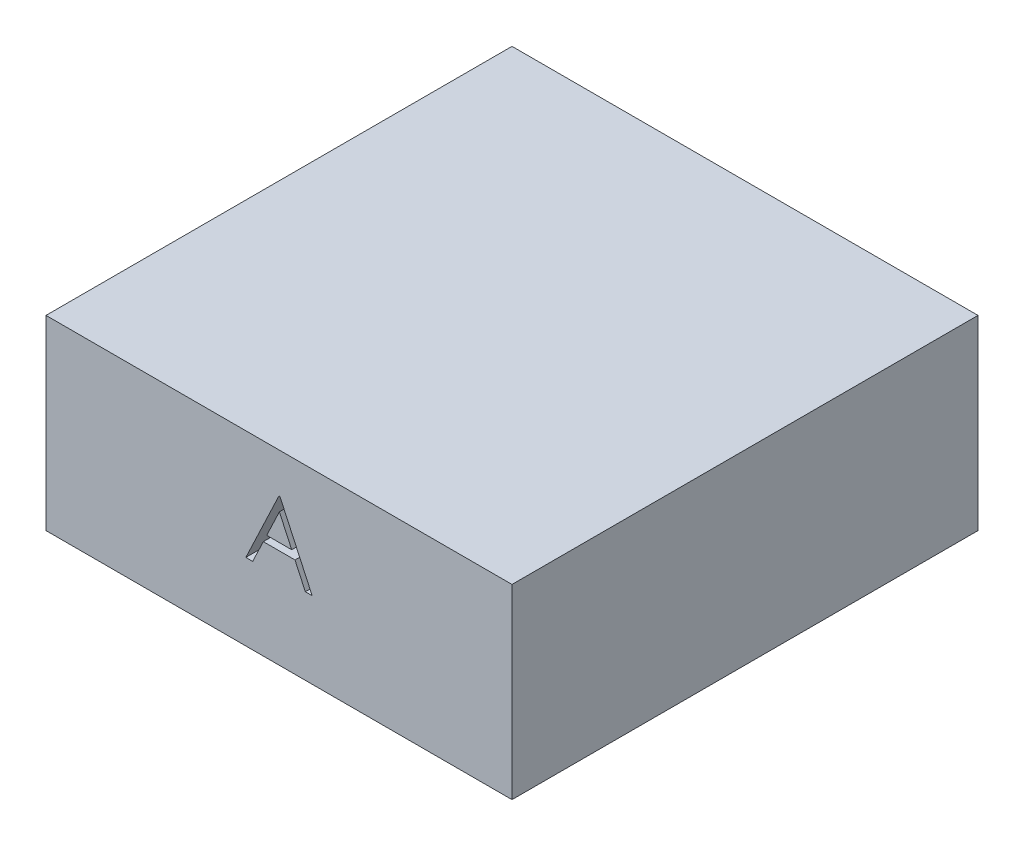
ISO-10303-21;
HEADER;
FILE_DESCRIPTION(('STEP AP214'),'2;1');
FILE_NAME('part.step','',(''),(''),'','','');
FILE_SCHEMA(('AUTOMOTIVE_DESIGN { 1 0 10303 214 1 1 1 1 }'));
ENDSEC;
DATA;
#1=APPLICATION_CONTEXT('core data for automotive mechanical design processes');
#2=APPLICATION_PROTOCOL_DEFINITION('international standard','automotive_design',2000,#1);
#3=PRODUCT_CONTEXT('',#1,'mechanical');
#4=PRODUCT('Part','Part','',(#3));
#5=PRODUCT_RELATED_PRODUCT_CATEGORY('part','',(#4));
#6=PRODUCT_DEFINITION_FORMATION('','',#4);
#7=PRODUCT_DEFINITION_CONTEXT('part definition',#1,'design');
#8=PRODUCT_DEFINITION('design','',#6,#7);
#9=PRODUCT_DEFINITION_SHAPE('','',#8);
#10=(LENGTH_UNIT() NAMED_UNIT(*) SI_UNIT(.MILLI.,.METRE.));
#11=(NAMED_UNIT(*) PLANE_ANGLE_UNIT() SI_UNIT($,.RADIAN.));
#12=(NAMED_UNIT(*) SI_UNIT($,.STERADIAN.) SOLID_ANGLE_UNIT());
#13=UNCERTAINTY_MEASURE_WITH_UNIT(LENGTH_MEASURE(1.E-05),#10,'distance_accuracy_value','');
#14=(GEOMETRIC_REPRESENTATION_CONTEXT(3) GLOBAL_UNCERTAINTY_ASSIGNED_CONTEXT((#13)) GLOBAL_UNIT_ASSIGNED_CONTEXT((#10,
#11,#12)) REPRESENTATION_CONTEXT('',''));
#15=CARTESIAN_POINT('',(0.,0.,0.));
#16=DIRECTION('',(0.,0.,1.));
#17=DIRECTION('',(1.,0.,0.));
#18=AXIS2_PLACEMENT_3D('',#15,#16,#17);
#19=CARTESIAN_POINT('',(-50.,40.,50.));
#20=DIRECTION('',(0.,0.,-1.));
#21=DIRECTION('',(-1.,0.,0.));
#22=AXIS2_PLACEMENT_3D('',#19,#20,#21);
#23=PLANE('',#22);
#24=DIRECTION('',(1.,0.,0.));
#25=VECTOR('',#24,1.);
#26=CARTESIAN_POINT('',(-50.,0.,50.));
#27=LINE('',#26,#25);
#28=CARTESIAN_POINT('',(-50.,0.,50.));
#29=VERTEX_POINT('',#28);
#30=CARTESIAN_POINT('',(50.,0.,50.));
#31=VERTEX_POINT('',#30);
#32=EDGE_CURVE('E506',#29,#31,#27,.T.);
#33=ORIENTED_EDGE('',*,*,#32,.T.);
#34=DIRECTION('',(0.,-1.,0.));
#35=VECTOR('',#34,1.);
#36=CARTESIAN_POINT('',(50.,40.,50.));
#37=LINE('',#36,#35);
#38=CARTESIAN_POINT('',(50.,40.,50.));
#39=VERTEX_POINT('',#38);
#40=EDGE_CURVE('E47',#39,#31,#37,.T.);
#41=ORIENTED_EDGE('',*,*,#40,.F.);
#42=DIRECTION('',(1.,0.,0.));
#43=VECTOR('',#42,1.);
#44=CARTESIAN_POINT('',(-50.,40.,50.));
#45=LINE('',#44,#43);
#46=CARTESIAN_POINT('',(-50.,40.,50.));
#47=VERTEX_POINT('',#46);
#48=EDGE_CURVE('E496',#47,#39,#45,.T.);
#49=ORIENTED_EDGE('',*,*,#48,.F.);
#50=DIRECTION('',(0.,-1.,0.));
#51=VECTOR('',#50,1.);
#52=CARTESIAN_POINT('',(-50.,40.,50.));
#53=LINE('',#52,#51);
#54=EDGE_CURVE('E11',#47,#29,#53,.T.);
#55=ORIENTED_EDGE('',*,*,#54,.T.);
#56=EDGE_LOOP('',(#33,#41,#49,#55));
#57=FACE_BOUND('',#56,.T.);
#58=DIRECTION('',(1.,0.,0.));
#59=VECTOR('',#58,1.);
#60=CARTESIAN_POINT('',(0.,31.4615344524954,50.));
#61=LINE('',#60,#59);
#62=CARTESIAN_POINT('',(0.,31.4615344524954,50.));
#63=VERTEX_POINT('',#62);
#64=CARTESIAN_POINT('',(0.192307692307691,31.4615344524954,50.));
#65=VERTEX_POINT('',#64);
#66=EDGE_CURVE('E54',#63,#65,#61,.T.);
#67=ORIENTED_EDGE('',*,*,#66,.T.);
#68=DIRECTION('',(0.419058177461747,-0.907959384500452,0.));
#69=VECTOR('',#68,1.);
#70=CARTESIAN_POINT('',(0.192307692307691,31.4615344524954,50.));
#71=LINE('',#70,#69);
#72=CARTESIAN_POINT('',(7.11538461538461,16.4615344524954,50.));
#73=VERTEX_POINT('',#72);
#74=EDGE_CURVE('E296',#65,#73,#71,.T.);
#75=ORIENTED_EDGE('',*,*,#74,.T.);
#76=DIRECTION('',(-1.,0.,0.));
#77=VECTOR('',#76,1.);
#78=CARTESIAN_POINT('',(7.11538461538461,16.4615344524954,50.));
#79=LINE('',#78,#77);
#80=CARTESIAN_POINT('',(5.65204326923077,16.4615344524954,50.));
#81=VERTEX_POINT('',#80);
#82=EDGE_CURVE('E299',#73,#81,#79,.T.);
#83=ORIENTED_EDGE('',*,*,#82,.T.);
#84=DIRECTION('',(-0.418842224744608,0.908059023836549,0.));
#85=VECTOR('',#84,1.);
#86=CARTESIAN_POINT('',(5.65204326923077,16.4615344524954,50.));
#87=LINE('',#86,#85);
#88=CARTESIAN_POINT('',(3.43449519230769,21.2692267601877,50.));
#89=VERTEX_POINT('',#88);
#90=EDGE_CURVE('E302',#81,#89,#87,.T.);
#91=ORIENTED_EDGE('',*,*,#90,.T.);
#92=DIRECTION('',(-1.,0.,0.));
#93=VECTOR('',#92,1.);
#94=CARTESIAN_POINT('',(3.43449519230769,21.2692267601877,50.));
#95=LINE('',#94,#93);
#96=CARTESIAN_POINT('',(-3.36538461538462,21.2692267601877,50.));
#97=VERTEX_POINT('',#96);
#98=EDGE_CURVE('E305',#89,#97,#95,.T.);
#99=ORIENTED_EDGE('',*,*,#98,.T.);
#100=DIRECTION('',(-0.428596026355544,-0.903496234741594,0.));
#101=VECTOR('',#100,1.);
#102=CARTESIAN_POINT('',(-3.36538461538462,21.2692267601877,50.));
#103=LINE('',#102,#101);
#104=CARTESIAN_POINT('',(-5.64603365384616,16.4615344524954,50.));
#105=VERTEX_POINT('',#104);
#106=EDGE_CURVE('E308',#97,#105,#103,.T.);
#107=ORIENTED_EDGE('',*,*,#106,.T.);
#108=DIRECTION('',(-1.,0.,0.));
#109=VECTOR('',#108,1.);
#110=CARTESIAN_POINT('',(-5.64603365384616,16.4615344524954,50.));
#111=LINE('',#110,#109);
#112=CARTESIAN_POINT('',(-7.11538461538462,16.4615344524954,50.));
#113=VERTEX_POINT('',#112);
#114=EDGE_CURVE('E311',#105,#113,#111,.T.);
#115=ORIENTED_EDGE('',*,*,#114,.T.);
#116=DIRECTION('',(0.428584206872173,0.903501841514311,0.));
#117=VECTOR('',#116,1.);
#118=CARTESIAN_POINT('',(-7.11538461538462,16.4615344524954,50.));
#119=LINE('',#118,#117);
#120=EDGE_CURVE('E280',#113,#63,#119,.T.);
#121=ORIENTED_EDGE('',*,*,#120,.T.);
#122=EDGE_LOOP('',(#67,#75,#83,#91,#99,#107,#115,#121));
#123=FACE_BOUND('',#122,.T.);
#124=ADVANCED_FACE('F39',(#57,#123),#23,.F.);
#125=CARTESIAN_POINT('',(0.,0.,0.));
#126=DIRECTION('',(0.,1.,0.));
#127=DIRECTION('',(0.,0.,1.));
#128=AXIS2_PLACEMENT_3D('',#125,#126,#127);
#129=PLANE('',#128);
#130=DIRECTION('',(0.,0.,-1.));
#131=VECTOR('',#130,1.);
#132=CARTESIAN_POINT('',(43.2161123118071,0.,-46.3643059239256));
#133=LINE('',#132,#131);
#134=CARTESIAN_POINT('',(43.2161123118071,0.,-34.6301297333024));
#135=VERTEX_POINT('',#134);
#136=CARTESIAN_POINT('',(43.2161123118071,0.,-46.3643059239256));
#137=VERTEX_POINT('',#136);
#138=EDGE_CURVE('E395',#135,#137,#133,.T.);
#139=ORIENTED_EDGE('',*,*,#138,.T.);
#140=DIRECTION('',(-1.,0.,0.));
#141=VECTOR('',#140,1.);
#142=CARTESIAN_POINT('',(32.9129332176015,0.,-46.3643059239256));
#143=LINE('',#142,#141);
#144=CARTESIAN_POINT('',(32.9129332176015,0.,-46.3643059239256));
#145=VERTEX_POINT('',#144);
#146=EDGE_CURVE('E409',#137,#145,#143,.T.);
#147=ORIENTED_EDGE('',*,*,#146,.T.);
#148=DIRECTION('',(0.,0.,1.));
#149=VECTOR('',#148,1.);
#150=CARTESIAN_POINT('',(32.9129332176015,0.,-46.3643059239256));
#151=LINE('',#150,#149);
#152=CARTESIAN_POINT('',(32.9129332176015,0.,-34.6301297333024));
#153=VERTEX_POINT('',#152);
#154=EDGE_CURVE('E412',#145,#153,#151,.T.);
#155=ORIENTED_EDGE('',*,*,#154,.T.);
#156=DIRECTION('',(1.,0.,0.));
#157=VECTOR('',#156,1.);
#158=CARTESIAN_POINT('',(32.9129332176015,0.,-34.6301297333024));
#159=LINE('',#158,#157);
#160=EDGE_CURVE('E400',#153,#135,#159,.T.);
#161=ORIENTED_EDGE('',*,*,#160,.T.);
#162=EDGE_LOOP('',(#139,#147,#155,#161));
#163=FACE_BOUND('',#162,.T.);
#164=DIRECTION('',(0.,0.,1.));
#165=VECTOR('',#164,1.);
#166=CARTESIAN_POINT('',(30.1940387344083,0.,32.3405343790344));
#167=LINE('',#166,#165);
#168=CARTESIAN_POINT('',(30.1940387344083,0.,32.3405343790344));
#169=VERTEX_POINT('',#168);
#170=CARTESIAN_POINT('',(30.1940387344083,0.,41.4989157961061));
#171=VERTEX_POINT('',#170);
#172=EDGE_CURVE('E331',#169,#171,#167,.T.);
#173=ORIENTED_EDGE('',*,*,#172,.T.);
#174=DIRECTION('',(1.,0.,0.));
#175=VECTOR('',#174,1.);
#176=CARTESIAN_POINT('',(38.4938218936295,0.,41.4989157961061));
#177=LINE('',#176,#175);
#178=CARTESIAN_POINT('',(38.4938218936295,0.,41.4989157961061));
#179=VERTEX_POINT('',#178);
#180=EDGE_CURVE('E345',#171,#179,#177,.T.);
#181=ORIENTED_EDGE('',*,*,#180,.T.);
#182=DIRECTION('',(0.,0.,-1.));
#183=VECTOR('',#182,1.);
#184=CARTESIAN_POINT('',(38.4938218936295,0.,32.3405343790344));
#185=LINE('',#184,#183);
#186=CARTESIAN_POINT('',(38.4938218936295,0.,32.3405343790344));
#187=VERTEX_POINT('',#186);
#188=EDGE_CURVE('E348',#179,#187,#185,.T.);
#189=ORIENTED_EDGE('',*,*,#188,.T.);
#190=DIRECTION('',(-1.,0.,0.));
#191=VECTOR('',#190,1.);
#192=CARTESIAN_POINT('',(38.4938218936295,0.,32.3405343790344));
#193=LINE('',#192,#191);
#194=EDGE_CURVE('E336',#187,#169,#193,.T.);
#195=ORIENTED_EDGE('',*,*,#194,.T.);
#196=EDGE_LOOP('',(#173,#181,#189,#195));
#197=FACE_BOUND('',#196,.T.);
#198=CARTESIAN_POINT('',(0.,0.,0.));
#199=DIRECTION('',(0.,-1.,0.));
#200=DIRECTION('',(0.,0.,-1.));
#201=AXIS2_PLACEMENT_3D('',#198,#199,#200);
#202=CIRCLE('',#201,37.5);
#203=CARTESIAN_POINT('',(0.,0.,-37.5));
#204=VERTEX_POINT('',#203);
#205=EDGE_CURVE('E459',#204,#204,#202,.F.);
#206=ORIENTED_EDGE('',*,*,#205,.T.);
#207=EDGE_LOOP('',(#206));
#208=FACE_BOUND('',#207,.T.);
#209=DIRECTION('',(0.,0.,1.));
#210=VECTOR('',#209,1.);
#211=CARTESIAN_POINT('',(-50.,0.,-50.));
#212=LINE('',#211,#210);
#213=CARTESIAN_POINT('',(-50.,0.,-50.));
#214=VERTEX_POINT('',#213);
#215=EDGE_CURVE('E490',#214,#29,#212,.T.);
#216=ORIENTED_EDGE('',*,*,#215,.F.);
#217=DIRECTION('',(-1.,0.,0.));
#218=VECTOR('',#217,1.);
#219=CARTESIAN_POINT('',(-50.,0.,-50.));
#220=LINE('',#219,#218);
#221=CARTESIAN_POINT('',(50.,0.,-50.));
#222=VERTEX_POINT('',#221);
#223=EDGE_CURVE('E497',#222,#214,#220,.T.);
#224=ORIENTED_EDGE('',*,*,#223,.F.);
#225=DIRECTION('',(0.,0.,-1.));
#226=VECTOR('',#225,1.);
#227=CARTESIAN_POINT('',(50.,0.,-50.));
#228=LINE('',#227,#226);
#229=EDGE_CURVE('E508',#31,#222,#228,.T.);
#230=ORIENTED_EDGE('',*,*,#229,.F.);
#231=ORIENTED_EDGE('',*,*,#32,.F.);
#232=EDGE_LOOP('',(#216,#224,#230,#231));
#233=FACE_BOUND('',#232,.T.);
#234=DIRECTION('',(0.,0.,-1.));
#235=VECTOR('',#234,1.);
#236=CARTESIAN_POINT('',(-38.780021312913,0.,23.611452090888));
#237=LINE('',#236,#235);
#238=CARTESIAN_POINT('',(-38.780021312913,0.,44.2178102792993));
#239=VERTEX_POINT('',#238);
#240=CARTESIAN_POINT('',(-38.780021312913,0.,23.611452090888));
#241=VERTEX_POINT('',#240);
#242=EDGE_CURVE('E363',#239,#241,#237,.T.);
#243=ORIENTED_EDGE('',*,*,#242,.T.);
#244=DIRECTION('',(-1.,0.,0.));
#245=VECTOR('',#244,1.);
#246=CARTESIAN_POINT('',(-45.9350067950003,0.,23.611452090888));
#247=LINE('',#246,#245);
#248=CARTESIAN_POINT('',(-45.9350067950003,0.,23.611452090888));
#249=VERTEX_POINT('',#248);
#250=EDGE_CURVE('E377',#241,#249,#247,.T.);
#251=ORIENTED_EDGE('',*,*,#250,.T.);
#252=DIRECTION('',(0.,0.,1.));
#253=VECTOR('',#252,1.);
#254=CARTESIAN_POINT('',(-45.9350067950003,0.,23.611452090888));
#255=LINE('',#254,#253);
#256=CARTESIAN_POINT('',(-45.9350067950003,0.,44.2178102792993));
#257=VERTEX_POINT('',#256);
#258=EDGE_CURVE('E380',#249,#257,#255,.T.);
#259=ORIENTED_EDGE('',*,*,#258,.T.);
#260=DIRECTION('',(1.,0.,0.));
#261=VECTOR('',#260,1.);
#262=CARTESIAN_POINT('',(-45.9350067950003,0.,44.2178102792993));
#263=LINE('',#262,#261);
#264=EDGE_CURVE('E368',#257,#239,#263,.T.);
#265=ORIENTED_EDGE('',*,*,#264,.T.);
#266=EDGE_LOOP('',(#243,#251,#259,#265));
#267=FACE_BOUND('',#266,.T.);
#268=DIRECTION('',(0.,0.,-1.));
#269=VECTOR('',#268,1.);
#270=CARTESIAN_POINT('',(-37.7783233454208,0.,-43.0730126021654));
#271=LINE('',#270,#269);
#272=CARTESIAN_POINT('',(-37.7783233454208,0.,-37.9214230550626));
#273=VERTEX_POINT('',#272);
#274=CARTESIAN_POINT('',(-37.7783233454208,0.,-43.0730126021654));
#275=VERTEX_POINT('',#274);
#276=EDGE_CURVE('E427',#273,#275,#271,.T.);
#277=ORIENTED_EDGE('',*,*,#276,.T.);
#278=DIRECTION('',(-1.,0.,0.));
#279=VECTOR('',#278,1.);
#280=CARTESIAN_POINT('',(-46.9367047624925,0.,-43.0730126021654));
#281=LINE('',#280,#279);
#282=CARTESIAN_POINT('',(-46.9367047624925,0.,-43.0730126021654));
#283=VERTEX_POINT('',#282);
#284=EDGE_CURVE('E441',#275,#283,#281,.T.);
#285=ORIENTED_EDGE('',*,*,#284,.T.);
#286=DIRECTION('',(0.,0.,1.));
#287=VECTOR('',#286,1.);
#288=CARTESIAN_POINT('',(-46.9367047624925,0.,-43.0730126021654));
#289=LINE('',#288,#287);
#290=CARTESIAN_POINT('',(-46.9367047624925,0.,-37.9214230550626));
#291=VERTEX_POINT('',#290);
#292=EDGE_CURVE('E444',#283,#291,#289,.T.);
#293=ORIENTED_EDGE('',*,*,#292,.T.);
#294=DIRECTION('',(1.,0.,0.));
#295=VECTOR('',#294,1.);
#296=CARTESIAN_POINT('',(-46.9367047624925,0.,-37.9214230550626));
#297=LINE('',#296,#295);
#298=EDGE_CURVE('E432',#291,#273,#297,.T.);
#299=ORIENTED_EDGE('',*,*,#298,.T.);
#300=EDGE_LOOP('',(#277,#285,#293,#299));
#301=FACE_BOUND('',#300,.T.);
#302=ADVANCED_FACE('F526',(#163,#197,#208,#233,#267,#301),#129,.F.);
#303=CARTESIAN_POINT('',(-50.,40.,-50.));
#304=DIRECTION('',(1.,0.,0.));
#305=DIRECTION('',(0.,0.,-1.));
#306=AXIS2_PLACEMENT_3D('',#303,#304,#305);
#307=PLANE('',#306);
#308=ORIENTED_EDGE('',*,*,#215,.T.);
#309=ORIENTED_EDGE('',*,*,#54,.F.);
#310=DIRECTION('',(0.,0.,1.));
#311=VECTOR('',#310,1.);
#312=CARTESIAN_POINT('',(-50.,40.,-50.));
#313=LINE('',#312,#311);
#314=CARTESIAN_POINT('',(-50.,40.,-50.));
#315=VERTEX_POINT('',#314);
#316=EDGE_CURVE('E493',#315,#47,#313,.T.);
#317=ORIENTED_EDGE('',*,*,#316,.F.);
#318=DIRECTION('',(0.,-1.,0.));
#319=VECTOR('',#318,1.);
#320=CARTESIAN_POINT('',(-50.,40.,-50.));
#321=LINE('',#320,#319);
#322=EDGE_CURVE('E503',#315,#214,#321,.T.);
#323=ORIENTED_EDGE('',*,*,#322,.T.);
#324=EDGE_LOOP('',(#308,#309,#317,#323));
#325=FACE_BOUND('',#324,.T.);
#326=ADVANCED_FACE('F41',(#325),#307,.F.);
#327=CARTESIAN_POINT('',(50.,40.,-50.));
#328=DIRECTION('',(-1.,0.,0.));
#329=DIRECTION('',(0.,0.,1.));
#330=AXIS2_PLACEMENT_3D('',#327,#328,#329);
#331=PLANE('',#330);
#332=ORIENTED_EDGE('',*,*,#229,.T.);
#333=DIRECTION('',(0.,-1.,0.));
#334=VECTOR('',#333,1.);
#335=CARTESIAN_POINT('',(50.,40.,-50.));
#336=LINE('',#335,#334);
#337=CARTESIAN_POINT('',(50.,40.,-50.));
#338=VERTEX_POINT('',#337);
#339=EDGE_CURVE('E513',#338,#222,#336,.T.);
#340=ORIENTED_EDGE('',*,*,#339,.F.);
#341=DIRECTION('',(0.,0.,-1.));
#342=VECTOR('',#341,1.);
#343=CARTESIAN_POINT('',(50.,40.,-50.));
#344=LINE('',#343,#342);
#345=EDGE_CURVE('E499',#39,#338,#344,.T.);
#346=ORIENTED_EDGE('',*,*,#345,.F.);
#347=ORIENTED_EDGE('',*,*,#40,.T.);
#348=EDGE_LOOP('',(#332,#340,#346,#347));
#349=FACE_BOUND('',#348,.T.);
#350=ADVANCED_FACE('F520',(#349),#331,.F.);
#351=CARTESIAN_POINT('',(-50.,40.,-50.));
#352=DIRECTION('',(0.,0.,1.));
#353=DIRECTION('',(1.,0.,0.));
#354=AXIS2_PLACEMENT_3D('',#351,#352,#353);
#355=PLANE('',#354);
#356=ORIENTED_EDGE('',*,*,#223,.T.);
#357=ORIENTED_EDGE('',*,*,#322,.F.);
#358=DIRECTION('',(-1.,0.,0.));
#359=VECTOR('',#358,1.);
#360=CARTESIAN_POINT('',(-50.,40.,-50.));
#361=LINE('',#360,#359);
#362=EDGE_CURVE('E501',#338,#315,#361,.T.);
#363=ORIENTED_EDGE('',*,*,#362,.F.);
#364=ORIENTED_EDGE('',*,*,#339,.T.);
#365=EDGE_LOOP('',(#356,#357,#363,#364));
#366=FACE_BOUND('',#365,.T.);
#367=ADVANCED_FACE('F530',(#366),#355,.F.);
#368=CARTESIAN_POINT('',(0.,40.,0.));
#369=DIRECTION('',(0.,1.,0.));
#370=DIRECTION('',(0.,0.,1.));
#371=AXIS2_PLACEMENT_3D('',#368,#369,#370);
#372=PLANE('',#371);
#373=ORIENTED_EDGE('',*,*,#316,.T.);
#374=ORIENTED_EDGE('',*,*,#48,.T.);
#375=ORIENTED_EDGE('',*,*,#345,.T.);
#376=ORIENTED_EDGE('',*,*,#362,.T.);
#377=EDGE_LOOP('',(#373,#374,#375,#376));
#378=FACE_BOUND('',#377,.T.);
#379=ADVANCED_FACE('F536',(#378),#372,.T.);
#380=CARTESIAN_POINT('',(0.,21.5943026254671,0.));
#381=DIRECTION('',(0.,1.,0.));
#382=DIRECTION('',(-1.,0.,0.));
#383=AXIS2_PLACEMENT_3D('',#380,#381,#382);
#384=TOROIDAL_SURFACE('',#383,24.2886000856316,5.);
#385=CARTESIAN_POINT('',(0.,24.9165030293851,0.));
#386=DIRECTION('',(0.,-1.,0.));
#387=DIRECTION('',(1.,0.,0.));
#388=AXIS2_PLACEMENT_3D('',#385,#386,#387);
#389=CIRCLE('',#388,28.0253077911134);
#390=CARTESIAN_POINT('',(28.0253077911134,24.9165030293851,0.));
#391=VERTEX_POINT('',#390);
#392=EDGE_CURVE('E487',#391,#391,#389,.T.);
#393=ORIENTED_EDGE('',*,*,#392,.T.);
#394=EDGE_LOOP('',(#393));
#395=FACE_BOUND('',#394,.T.);
#396=CARTESIAN_POINT('',(0.,26.5943026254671,0.));
#397=DIRECTION('',(0.,1.,0.));
#398=DIRECTION('',(-1.,0.,0.));
#399=AXIS2_PLACEMENT_3D('',#396,#397,#398);
#400=CIRCLE('',#399,24.2886000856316);
#401=CARTESIAN_POINT('',(-24.2886000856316,26.5943026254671,0.));
#402=VERTEX_POINT('',#401);
#403=EDGE_CURVE('E484',#402,#402,#400,.T.);
#404=ORIENTED_EDGE('',*,*,#403,.T.);
#405=EDGE_LOOP('',(#404));
#406=FACE_BOUND('',#405,.T.);
#407=ADVANCED_FACE('F714',(#395,#406),#384,.F.);
#408=CARTESIAN_POINT('',(0.,27.5943026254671,0.));
#409=DIRECTION('',(0.,-1.,0.));
#410=DIRECTION('',(1.,0.,0.));
#411=AXIS2_PLACEMENT_3D('',#408,#409,#410);
#412=TOROIDAL_SURFACE('',#411,3.73626592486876,1.);
#413=CARTESIAN_POINT('',(0.,27.2522824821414,0.));
#414=DIRECTION('',(0.,1.,0.));
#415=DIRECTION('',(-1.,0.,0.));
#416=AXIS2_PLACEMENT_3D('',#413,#414,#415);
#417=CIRCLE('',#416,4.67595854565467);
#418=CARTESIAN_POINT('',(-4.67595854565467,27.2522824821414,0.));
#419=VERTEX_POINT('',#418);
#420=EDGE_CURVE('E475',#419,#419,#417,.F.);
#421=ORIENTED_EDGE('',*,*,#420,.T.);
#422=EDGE_LOOP('',(#421));
#423=FACE_BOUND('',#422,.T.);
#424=CARTESIAN_POINT('',(0.,26.5943026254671,0.));
#425=DIRECTION('',(0.,-1.,0.));
#426=DIRECTION('',(1.,0.,0.));
#427=AXIS2_PLACEMENT_3D('',#424,#425,#426);
#428=CIRCLE('',#427,3.73626592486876);
#429=CARTESIAN_POINT('',(3.73626592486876,26.5943026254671,0.));
#430=VERTEX_POINT('',#429);
#431=EDGE_CURVE('E481',#430,#430,#428,.F.);
#432=ORIENTED_EDGE('',*,*,#431,.T.);
#433=EDGE_LOOP('',(#432));
#434=FACE_BOUND('',#433,.T.);
#435=ADVANCED_FACE('F710',(#423,#434),#412,.T.);
#436=CARTESIAN_POINT('',(0.,35.4427726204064,0.));
#437=DIRECTION('',(0.,-1.,0.));
#438=DIRECTION('',(1.,0.,0.));
#439=AXIS2_PLACEMENT_3D('',#436,#437,#438);
#440=TOROIDAL_SURFACE('',#439,8.72123093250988,1.);
#441=CARTESIAN_POINT('',(0.,36.4138074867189,0.));
#442=DIRECTION('',(0.,-1.,0.));
#443=DIRECTION('',(1.,0.,0.));
#444=AXIS2_PLACEMENT_3D('',#441,#442,#443);
#445=CIRCLE('',#444,8.96016876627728);
#446=CARTESIAN_POINT('',(8.96016876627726,36.413807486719,0.));
#447=VERTEX_POINT('',#446);
#448=EDGE_CURVE('E460',#447,#447,#445,.T.);
#449=ORIENTED_EDGE('',*,*,#448,.T.);
#450=EDGE_LOOP('',(#449));
#451=FACE_BOUND('',#450,.T.);
#452=CARTESIAN_POINT('',(0.,35.7847927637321,0.));
#453=DIRECTION('',(0.,1.,0.));
#454=DIRECTION('',(-1.,0.,0.));
#455=AXIS2_PLACEMENT_3D('',#452,#453,#454);
#456=CIRCLE('',#455,7.78153831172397);
#457=CARTESIAN_POINT('',(-7.78153831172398,35.7847927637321,0.));
#458=VERTEX_POINT('',#457);
#459=EDGE_CURVE('E478',#458,#458,#456,.T.);
#460=ORIENTED_EDGE('',*,*,#459,.T.);
#461=EDGE_LOOP('',(#460));
#462=FACE_BOUND('',#461,.T.);
#463=ADVANCED_FACE('F706',(#451,#462),#440,.F.);
#464=CARTESIAN_POINT('',(0.,27.5943026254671,0.));
#465=DIRECTION('',(0.,1.,0.));
#466=DIRECTION('',(-1.,0.,0.));
#467=AXIS2_PLACEMENT_3D('',#464,#465,#466);
#468=TOROIDAL_SURFACE('',#467,19.1318013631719,1.);
#469=CARTESIAN_POINT('',(0.,26.5943026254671,0.));
#470=DIRECTION('',(0.,1.,0.));
#471=DIRECTION('',(-1.,0.,0.));
#472=AXIS2_PLACEMENT_3D('',#469,#470,#471);
#473=CIRCLE('',#472,19.1318013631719);
#474=CARTESIAN_POINT('',(-19.1318013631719,26.5943026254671,0.));
#475=VERTEX_POINT('',#474);
#476=EDGE_CURVE('E472',#475,#475,#473,.F.);
#477=ORIENTED_EDGE('',*,*,#476,.T.);
#478=EDGE_LOOP('',(#477));
#479=FACE_BOUND('',#478,.T.);
#480=CARTESIAN_POINT('',(0.,27.2435888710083,0.));
#481=DIRECTION('',(0.,-1.,0.));
#482=DIRECTION('',(1.,0.,0.));
#483=AXIS2_PLACEMENT_3D('',#480,#481,#482);
#484=CIRCLE('',#483,18.195318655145);
#485=CARTESIAN_POINT('',(18.195318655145,27.2435888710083,0.));
#486=VERTEX_POINT('',#485);
#487=EDGE_CURVE('E466',#486,#486,#484,.F.);
#488=ORIENTED_EDGE('',*,*,#487,.T.);
#489=EDGE_LOOP('',(#488));
#490=FACE_BOUND('',#489,.T.);
#491=ADVANCED_FACE('F702',(#479,#490),#468,.T.);
#492=CARTESIAN_POINT('',(0.,33.3460961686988,0.));
#493=DIRECTION('',(0.,-1.,0.));
#494=DIRECTION('',(1.,0.,0.));
#495=AXIS2_PLACEMENT_3D('',#492,#493,#494);
#496=TOROIDAL_SURFACE('',#495,14.8420979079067,1.);
#497=CARTESIAN_POINT('',(0.,33.6968099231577,0.));
#498=DIRECTION('',(0.,1.,0.));
#499=DIRECTION('',(-1.,0.,0.));
#500=AXIS2_PLACEMENT_3D('',#497,#498,#499);
#501=CIRCLE('',#500,15.7785806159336);
#502=CARTESIAN_POINT('',(-15.7785806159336,33.6968099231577,0.));
#503=VERTEX_POINT('',#502);
#504=EDGE_CURVE('E469',#503,#503,#501,.F.);
#505=ORIENTED_EDGE('',*,*,#504,.T.);
#506=EDGE_LOOP('',(#505));
#507=FACE_BOUND('',#506,.T.);
#508=CARTESIAN_POINT('',(0.,34.2596878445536,0.));
#509=DIRECTION('',(0.,-1.,0.));
#510=DIRECTION('',(1.,0.,0.));
#511=AXIS2_PLACEMENT_3D('',#508,#509,#510);
#512=CIRCLE('',#511,15.2487307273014);
#513=CARTESIAN_POINT('',(15.2487307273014,34.2596878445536,0.));
#514=VERTEX_POINT('',#513);
#515=EDGE_CURVE('E463',#514,#514,#512,.F.);
#516=ORIENTED_EDGE('',*,*,#515,.T.);
#517=EDGE_LOOP('',(#516));
#518=FACE_BOUND('',#517,.T.);
#519=ADVANCED_FACE('F680',(#507,#518),#496,.F.);
#520=CARTESIAN_POINT('',(0.,26.5943026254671,0.));
#521=DIRECTION('',(0.,-1.,0.));
#522=DIRECTION('',(1.,0.,0.));
#523=AXIS2_PLACEMENT_3D('',#520,#521,#522);
#524=PLANE('',#523);
#525=ORIENTED_EDGE('',*,*,#431,.F.);
#526=EDGE_LOOP('',(#525));
#527=FACE_BOUND('',#526,.T.);
#528=ADVANCED_FACE('F676',(#527),#524,.T.);
#529=CARTESIAN_POINT('',(0.,36.6181019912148,0.));
#530=DIRECTION('',(0.,1.,0.));
#531=DIRECTION('',(-1.,0.,0.));
#532=AXIS2_PLACEMENT_3D('',#529,#530,#531);
#533=CONICAL_SURFACE('',#532,8.08483806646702,0.349065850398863);
#534=ORIENTED_EDGE('',*,*,#459,.F.);
#535=EDGE_LOOP('',(#534));
#536=FACE_BOUND('',#535,.T.);
#537=ORIENTED_EDGE('',*,*,#420,.F.);
#538=EDGE_LOOP('',(#537));
#539=FACE_BOUND('',#538,.T.);
#540=ADVANCED_FACE('F679',(#536,#539),#533,.T.);
#541=CARTESIAN_POINT('',(0.,0.,0.));
#542=DIRECTION('',(0.,1.,0.));
#543=DIRECTION('',(1.,0.,0.));
#544=AXIS2_PLACEMENT_3D('',#541,#542,#543);
#545=SPHERICAL_SURFACE('',#544,37.5);
#546=CARTESIAN_POINT('',(15.2487307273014,34.2596878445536,0.));
#547=CARTESIAN_POINT('',(15.1853883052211,34.2878810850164,0.));
#548=CARTESIAN_POINT('',(15.1219676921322,34.3158986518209,0.));
#549=CARTESIAN_POINT('',(14.994972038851,34.3715815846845,0.));
#550=CARTESIAN_POINT('',(14.9313969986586,34.3992469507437,0.));
#551=CARTESIAN_POINT('',(14.804094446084,34.4542246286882,0.));
#552=CARTESIAN_POINT('',(14.7403669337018,34.4815369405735,0.));
#553=CARTESIAN_POINT('',(14.6127613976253,34.5358076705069,0.));
#554=CARTESIAN_POINT('',(14.548883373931,34.5627660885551,0.));
#555=CARTESIAN_POINT('',(14.4209787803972,34.6163282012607,0.));
#556=CARTESIAN_POINT('',(14.3569522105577,34.6429318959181,0.));
#557=CARTESIAN_POINT('',(14.2287524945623,34.6957837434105,0.));
#558=CARTESIAN_POINT('',(14.1645793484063,34.7220318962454,0.));
#559=CARTESIAN_POINT('',(14.0360884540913,34.7741718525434,0.));
#560=CARTESIAN_POINT('',(13.9717707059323,34.8000636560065,0.));
#561=CARTESIAN_POINT('',(13.8429925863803,34.8514901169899,0.));
#562=CARTESIAN_POINT('',(13.7785322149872,34.8770247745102,0.));
#563=CARTESIAN_POINT('',(13.6494708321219,34.9277361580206,0.));
#564=CARTESIAN_POINT('',(13.5848698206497,34.9529128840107,0.));
#565=CARTESIAN_POINT('',(13.4555291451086,35.0029076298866,0.));
#566=CARTESIAN_POINT('',(13.3907894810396,35.0277256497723,0.));
#567=CARTESIAN_POINT('',(13.2611734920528,35.0770022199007,0.));
#568=CARTESIAN_POINT('',(13.196297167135,35.1014607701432,0.));
#569=CARTESIAN_POINT('',(13.0664098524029,35.1500176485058,0.));
#570=CARTESIAN_POINT('',(13.0013988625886,35.1741159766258,0.));
#571=CARTESIAN_POINT('',(12.871244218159,35.2219516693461,0.));
#572=CARTESIAN_POINT('',(12.8061005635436,35.2456890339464,0.));
#573=CARTESIAN_POINT('',(12.6756825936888,35.2928020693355,0.));
#574=CARTESIAN_POINT('',(12.6104082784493,35.3161777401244,0.));
#575=CARTESIAN_POINT('',(12.479730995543,35.3625666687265,0.));
#576=CARTESIAN_POINT('',(12.4143280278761,35.3855799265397,0.));
#577=CARTESIAN_POINT('',(12.2833954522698,35.4312433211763,0.));
#578=CARTESIAN_POINT('',(12.2178658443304,35.4538934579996,0.));
#579=CARTESIAN_POINT('',(12.0866820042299,35.4988299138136,0.));
#580=CARTESIAN_POINT('',(12.0210277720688,35.5211162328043,0.));
#581=CARTESIAN_POINT('',(11.8895967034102,35.5653243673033,0.));
#582=CARTESIAN_POINT('',(11.8238198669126,35.5872461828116,0.));
#583=CARTESIAN_POINT('',(11.692145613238,35.6307246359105,0.));
#584=CARTESIAN_POINT('',(11.626248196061,35.652281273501,0.));
#585=CARTESIAN_POINT('',(11.4943348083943,35.6950287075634,0.));
#586=CARTESIAN_POINT('',(11.4283188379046,35.7162195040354,0.));
#587=CARTESIAN_POINT('',(11.2961703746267,35.7582346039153,0.));
#588=CARTESIAN_POINT('',(11.2300378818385,35.7790589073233,0.));
#589=CARTESIAN_POINT('',(11.0976584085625,35.8203403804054,0.));
#590=CARTESIAN_POINT('',(11.0314114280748,35.8407975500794,0.));
#591=CARTESIAN_POINT('',(10.8988050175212,35.8813441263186,0.));
#592=CARTESIAN_POINT('',(10.8324455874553,35.9014335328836,0.));
#593=CARTESIAN_POINT('',(10.6996163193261,35.9412439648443,0.));
#594=CARTESIAN_POINT('',(10.6331464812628,35.9609649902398,0.));
#595=CARTESIAN_POINT('',(10.5000984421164,36.0000380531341,0.));
#596=CARTESIAN_POINT('',(10.4335202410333,36.0193900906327,0.));
#597=CARTESIAN_POINT('',(10.300257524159,36.0577245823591,0.));
#598=CARTESIAN_POINT('',(10.2335730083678,36.0767070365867,0.));
#599=CARTESIAN_POINT('',(10.1000997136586,36.114301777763,0.));
#600=CARTESIAN_POINT('',(10.0333109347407,36.1329140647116,0.));
#601=CARTESIAN_POINT('',(9.89963116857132,36.169767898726,0.));
#602=CARTESIAN_POINT('',(9.83274018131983,36.1880094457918,0.));
#603=CARTESIAN_POINT('',(9.69885805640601,36.2241212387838,0.));
#604=CARTESIAN_POINT('',(9.63186691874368,36.2419914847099,0.));
#605=CARTESIAN_POINT('',(9.49778655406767,36.2773601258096,0.));
#606=CARTESIAN_POINT('',(9.43069732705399,36.2948585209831,0.));
#607=CARTESIAN_POINT('',(9.29642284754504,36.329482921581,0.));
#608=CARTESIAN_POINT('',(9.22923759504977,36.3466089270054,0.));
#609=CARTESIAN_POINT('',(9.09477313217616,36.3804880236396,0.));
#610=CARTESIAN_POINT('',(9.02749392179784,36.3972411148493,0.));
#611=CARTESIAN_POINT('',(8.96016876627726,36.413807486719,0.));
#612=B_SPLINE_CURVE_WITH_KNOTS('',3,(#546,#547,#548,#549,#550,#551,#552,#553,#554,#555,#556,
#557,#558,#559,#560,#561,#562,#563,#564,#565,#566,#567,#568,#569,#570,#571,#572,#573,#574,#575,
#576,#577,#578,#579,#580,#581,#582,#583,#584,#585,#586,#587,#588,#589,#590,#591,#592,#593,#594,
#595,#596,#597,#598,#599,#600,#601,#602,#603,#604,#605,#606,#607,#608,#609,#610,#611),
.UNSPECIFIED.,.F.,.F.,(4,2,2,2,2,2,2,2,2,2,2,2,2,2,2,2,2,2,2,2,2,2,2,2,2,2,2,2,2,2,2,2,4),(0.,
0.20799995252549,0.415999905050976,0.623999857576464,0.831999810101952,1.03999976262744,
1.24799971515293,1.45599966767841,1.66399962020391,1.8719995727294,2.07999952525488,
2.28799947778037,2.49599943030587,2.70399938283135,2.91199933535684,3.11999928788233,
3.32799924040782,3.53599919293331,3.74399914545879,3.95199909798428,4.15999905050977,
4.36799900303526,4.57599895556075,4.78399890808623,4.99199886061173,5.19999881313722,
5.4079987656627,5.61599871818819,5.82399867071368,6.03199862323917,6.23999857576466,
6.44799852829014,6.65599848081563),.UNSPECIFIED.);
#613=EDGE_CURVE('BSEAM684',#514,#447,#612,.T.);
#614=ORIENTED_EDGE('',*,*,#515,.F.);
#615=ORIENTED_EDGE('',*,*,#448,.F.);
#616=ORIENTED_EDGE('',*,*,#613,.T.);
#617=ORIENTED_EDGE('',*,*,#613,.F.);
#618=EDGE_LOOP('',(#614,#616,#615,#617));
#619=FACE_BOUND('',#618,.T.);
#620=ADVANCED_FACE('F684',(#619),#545,.F.);
#621=CARTESIAN_POINT('',(0.,34.0861642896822,0.));
#622=DIRECTION('',(0.,-1.,0.));
#623=DIRECTION('',(1.,0.,0.));
#624=AXIS2_PLACEMENT_3D('',#621,#622,#623);
#625=CONICAL_SURFACE('',#624,15.632766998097,0.358333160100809);
#626=ORIENTED_EDGE('',*,*,#504,.F.);
#627=EDGE_LOOP('',(#626));
#628=FACE_BOUND('',#627,.T.);
#629=ORIENTED_EDGE('',*,*,#487,.F.);
#630=EDGE_LOOP('',(#629));
#631=FACE_BOUND('',#630,.T.);
#632=ADVANCED_FACE('F688',(#628,#631),#625,.F.);
#633=CARTESIAN_POINT('',(0.,26.5943026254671,0.));
#634=DIRECTION('',(0.,1.,0.));
#635=DIRECTION('',(-1.,0.,0.));
#636=AXIS2_PLACEMENT_3D('',#633,#634,#635);
#637=PLANE('',#636);
#638=ORIENTED_EDGE('',*,*,#403,.F.);
#639=EDGE_LOOP('',(#638));
#640=FACE_BOUND('',#639,.T.);
#641=ORIENTED_EDGE('',*,*,#476,.F.);
#642=EDGE_LOOP('',(#641));
#643=FACE_BOUND('',#642,.T.);
#644=ADVANCED_FACE('F692',(#640,#643),#637,.F.);
#645=CARTESIAN_POINT('',(0.,0.,0.));
#646=DIRECTION('',(0.,1.,0.));
#647=DIRECTION('',(1.,0.,0.));
#648=AXIS2_PLACEMENT_3D('',#645,#646,#647);
#649=SPHERICAL_SURFACE('',#648,37.5);
#650=ORIENTED_EDGE('',*,*,#392,.F.);
#651=EDGE_LOOP('',(#650));
#652=FACE_BOUND('',#651,.T.);
#653=ORIENTED_EDGE('',*,*,#205,.F.);
#654=EDGE_LOOP('',(#653));
#655=FACE_BOUND('',#654,.T.);
#656=ADVANCED_FACE('F600',(#652,#655),#649,.F.);
#657=CARTESIAN_POINT('',(0.,15.,0.));
#658=DIRECTION('',(0.,-1.,0.));
#659=DIRECTION('',(0.,0.,-1.));
#660=AXIS2_PLACEMENT_3D('',#657,#658,#659);
#661=PLANE('',#660);
#662=DIRECTION('',(0.,0.,1.));
#663=VECTOR('',#662,1.);
#664=CARTESIAN_POINT('',(30.1940387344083,15.,32.3405343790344));
#665=LINE('',#664,#663);
#666=CARTESIAN_POINT('',(30.1940387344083,15.,32.3405343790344));
#667=VERTEX_POINT('',#666);
#668=CARTESIAN_POINT('',(30.1940387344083,15.,41.4989157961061));
#669=VERTEX_POINT('',#668);
#670=EDGE_CURVE('E332',#667,#669,#665,.T.);
#671=ORIENTED_EDGE('',*,*,#670,.F.);
#672=DIRECTION('',(-1.,0.,0.));
#673=VECTOR('',#672,1.);
#674=CARTESIAN_POINT('',(38.4938218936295,15.,32.3405343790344));
#675=LINE('',#674,#673);
#676=CARTESIAN_POINT('',(38.4938218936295,15.,32.3405343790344));
#677=VERTEX_POINT('',#676);
#678=EDGE_CURVE('E340',#677,#667,#675,.T.);
#679=ORIENTED_EDGE('',*,*,#678,.F.);
#680=DIRECTION('',(0.,0.,-1.));
#681=VECTOR('',#680,1.);
#682=CARTESIAN_POINT('',(38.4938218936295,15.,32.3405343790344));
#683=LINE('',#682,#681);
#684=CARTESIAN_POINT('',(38.4938218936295,15.,41.4989157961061));
#685=VERTEX_POINT('',#684);
#686=EDGE_CURVE('E338',#685,#677,#683,.T.);
#687=ORIENTED_EDGE('',*,*,#686,.F.);
#688=DIRECTION('',(1.,0.,0.));
#689=VECTOR('',#688,1.);
#690=CARTESIAN_POINT('',(38.4938218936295,15.,41.4989157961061));
#691=LINE('',#690,#689);
#692=EDGE_CURVE('E335',#669,#685,#691,.T.);
#693=ORIENTED_EDGE('',*,*,#692,.F.);
#694=EDGE_LOOP('',(#671,#679,#687,#693));
#695=FACE_BOUND('',#694,.T.);
#696=ADVANCED_FACE('F596',(#695),#661,.T.);
#697=CARTESIAN_POINT('',(38.4938218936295,15.,32.3405343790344));
#698=DIRECTION('',(0.,0.,1.));
#699=DIRECTION('',(1.,0.,0.));
#700=AXIS2_PLACEMENT_3D('',#697,#698,#699);
#701=PLANE('',#700);
#702=ORIENTED_EDGE('',*,*,#194,.F.);
#703=DIRECTION('',(0.,-1.,0.));
#704=VECTOR('',#703,1.);
#705=CARTESIAN_POINT('',(38.4938218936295,15.,32.3405343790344));
#706=LINE('',#705,#704);
#707=EDGE_CURVE('E354',#677,#187,#706,.T.);
#708=ORIENTED_EDGE('',*,*,#707,.F.);
#709=ORIENTED_EDGE('',*,*,#678,.T.);
#710=DIRECTION('',(0.,-1.,0.));
#711=VECTOR('',#710,1.);
#712=CARTESIAN_POINT('',(30.1940387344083,15.,32.3405343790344));
#713=LINE('',#712,#711);
#714=EDGE_CURVE('E342',#667,#169,#713,.T.);
#715=ORIENTED_EDGE('',*,*,#714,.T.);
#716=EDGE_LOOP('',(#702,#708,#709,#715));
#717=FACE_BOUND('',#716,.T.);
#718=ADVANCED_FACE('F599',(#717),#701,.T.);
#719=CARTESIAN_POINT('',(38.4938218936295,15.,32.3405343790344));
#720=DIRECTION('',(-1.,0.,0.));
#721=DIRECTION('',(0.,0.,1.));
#722=AXIS2_PLACEMENT_3D('',#719,#720,#721);
#723=PLANE('',#722);
#724=ORIENTED_EDGE('',*,*,#188,.F.);
#725=DIRECTION('',(0.,-1.,0.));
#726=VECTOR('',#725,1.);
#727=CARTESIAN_POINT('',(38.4938218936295,15.,41.4989157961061));
#728=LINE('',#727,#726);
#729=EDGE_CURVE('E357',#685,#179,#728,.T.);
#730=ORIENTED_EDGE('',*,*,#729,.F.);
#731=ORIENTED_EDGE('',*,*,#686,.T.);
#732=ORIENTED_EDGE('',*,*,#707,.T.);
#733=EDGE_LOOP('',(#724,#730,#731,#732));
#734=FACE_BOUND('',#733,.T.);
#735=ADVANCED_FACE('F604',(#734),#723,.T.);
#736=CARTESIAN_POINT('',(38.4938218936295,15.,41.4989157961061));
#737=DIRECTION('',(0.,0.,-1.));
#738=DIRECTION('',(-1.,0.,0.));
#739=AXIS2_PLACEMENT_3D('',#736,#737,#738);
#740=PLANE('',#739);
#741=ORIENTED_EDGE('',*,*,#180,.F.);
#742=DIRECTION('',(0.,-1.,0.));
#743=VECTOR('',#742,1.);
#744=CARTESIAN_POINT('',(30.1940387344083,15.,41.4989157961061));
#745=LINE('',#744,#743);
#746=EDGE_CURVE('E360',#669,#171,#745,.T.);
#747=ORIENTED_EDGE('',*,*,#746,.F.);
#748=ORIENTED_EDGE('',*,*,#692,.T.);
#749=ORIENTED_EDGE('',*,*,#729,.T.);
#750=EDGE_LOOP('',(#741,#747,#748,#749));
#751=FACE_BOUND('',#750,.T.);
#752=ADVANCED_FACE('F608',(#751),#740,.T.);
#753=CARTESIAN_POINT('',(30.1940387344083,15.,32.3405343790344));
#754=DIRECTION('',(1.,0.,0.));
#755=DIRECTION('',(0.,0.,-1.));
#756=AXIS2_PLACEMENT_3D('',#753,#754,#755);
#757=PLANE('',#756);
#758=ORIENTED_EDGE('',*,*,#172,.F.);
#759=ORIENTED_EDGE('',*,*,#714,.F.);
#760=ORIENTED_EDGE('',*,*,#670,.T.);
#761=ORIENTED_EDGE('',*,*,#746,.T.);
#762=EDGE_LOOP('',(#758,#759,#760,#761));
#763=FACE_BOUND('',#762,.T.);
#764=ADVANCED_FACE('F612',(#763),#757,.T.);
#765=CARTESIAN_POINT('',(0.,15.,0.));
#766=DIRECTION('',(0.,1.,0.));
#767=DIRECTION('',(0.,0.,1.));
#768=AXIS2_PLACEMENT_3D('',#765,#766,#767);
#769=PLANE('',#768);
#770=DIRECTION('',(0.,0.,-1.));
#771=VECTOR('',#770,1.);
#772=CARTESIAN_POINT('',(-38.780021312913,15.,23.611452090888));
#773=LINE('',#772,#771);
#774=CARTESIAN_POINT('',(-38.780021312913,15.,44.2178102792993));
#775=VERTEX_POINT('',#774);
#776=CARTESIAN_POINT('',(-38.780021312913,15.,23.611452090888));
#777=VERTEX_POINT('',#776);
#778=EDGE_CURVE('E364',#775,#777,#773,.T.);
#779=ORIENTED_EDGE('',*,*,#778,.F.);
#780=DIRECTION('',(1.,0.,0.));
#781=VECTOR('',#780,1.);
#782=CARTESIAN_POINT('',(-45.9350067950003,15.,44.2178102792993));
#783=LINE('',#782,#781);
#784=CARTESIAN_POINT('',(-45.9350067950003,15.,44.2178102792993));
#785=VERTEX_POINT('',#784);
#786=EDGE_CURVE('E372',#785,#775,#783,.T.);
#787=ORIENTED_EDGE('',*,*,#786,.F.);
#788=DIRECTION('',(0.,0.,1.));
#789=VECTOR('',#788,1.);
#790=CARTESIAN_POINT('',(-45.9350067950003,15.,23.611452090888));
#791=LINE('',#790,#789);
#792=CARTESIAN_POINT('',(-45.9350067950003,15.,23.611452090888));
#793=VERTEX_POINT('',#792);
#794=EDGE_CURVE('E370',#793,#785,#791,.T.);
#795=ORIENTED_EDGE('',*,*,#794,.F.);
#796=DIRECTION('',(-1.,0.,0.));
#797=VECTOR('',#796,1.);
#798=CARTESIAN_POINT('',(-45.9350067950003,15.,23.611452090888));
#799=LINE('',#798,#797);
#800=EDGE_CURVE('E367',#777,#793,#799,.T.);
#801=ORIENTED_EDGE('',*,*,#800,.F.);
#802=EDGE_LOOP('',(#779,#787,#795,#801));
#803=FACE_BOUND('',#802,.T.);
#804=ADVANCED_FACE('F616',(#803),#769,.F.);
#805=CARTESIAN_POINT('',(-45.9350067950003,15.,44.2178102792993));
#806=DIRECTION('',(0.,0.,-1.));
#807=DIRECTION('',(-1.,0.,0.));
#808=AXIS2_PLACEMENT_3D('',#805,#806,#807);
#809=PLANE('',#808);
#810=ORIENTED_EDGE('',*,*,#264,.F.);
#811=DIRECTION('',(0.,-1.,0.));
#812=VECTOR('',#811,1.);
#813=CARTESIAN_POINT('',(-45.9350067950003,15.,44.2178102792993));
#814=LINE('',#813,#812);
#815=EDGE_CURVE('E386',#785,#257,#814,.T.);
#816=ORIENTED_EDGE('',*,*,#815,.F.);
#817=ORIENTED_EDGE('',*,*,#786,.T.);
#818=DIRECTION('',(0.,-1.,0.));
#819=VECTOR('',#818,1.);
#820=CARTESIAN_POINT('',(-38.780021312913,15.,44.2178102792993));
#821=LINE('',#820,#819);
#822=EDGE_CURVE('E374',#775,#239,#821,.T.);
#823=ORIENTED_EDGE('',*,*,#822,.T.);
#824=EDGE_LOOP('',(#810,#816,#817,#823));
#825=FACE_BOUND('',#824,.T.);
#826=ADVANCED_FACE('F620',(#825),#809,.T.);
#827=CARTESIAN_POINT('',(-45.9350067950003,15.,23.611452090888));
#828=DIRECTION('',(1.,0.,0.));
#829=DIRECTION('',(0.,0.,-1.));
#830=AXIS2_PLACEMENT_3D('',#827,#828,#829);
#831=PLANE('',#830);
#832=ORIENTED_EDGE('',*,*,#258,.F.);
#833=DIRECTION('',(0.,-1.,0.));
#834=VECTOR('',#833,1.);
#835=CARTESIAN_POINT('',(-45.9350067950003,15.,23.611452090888));
#836=LINE('',#835,#834);
#837=EDGE_CURVE('E389',#793,#249,#836,.T.);
#838=ORIENTED_EDGE('',*,*,#837,.F.);
#839=ORIENTED_EDGE('',*,*,#794,.T.);
#840=ORIENTED_EDGE('',*,*,#815,.T.);
#841=EDGE_LOOP('',(#832,#838,#839,#840));
#842=FACE_BOUND('',#841,.T.);
#843=ADVANCED_FACE('F624',(#842),#831,.T.);
#844=CARTESIAN_POINT('',(-45.9350067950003,15.,23.611452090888));
#845=DIRECTION('',(0.,0.,1.));
#846=DIRECTION('',(1.,0.,0.));
#847=AXIS2_PLACEMENT_3D('',#844,#845,#846);
#848=PLANE('',#847);
#849=ORIENTED_EDGE('',*,*,#250,.F.);
#850=DIRECTION('',(0.,-1.,0.));
#851=VECTOR('',#850,1.);
#852=CARTESIAN_POINT('',(-38.780021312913,15.,23.611452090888));
#853=LINE('',#852,#851);
#854=EDGE_CURVE('E392',#777,#241,#853,.T.);
#855=ORIENTED_EDGE('',*,*,#854,.F.);
#856=ORIENTED_EDGE('',*,*,#800,.T.);
#857=ORIENTED_EDGE('',*,*,#837,.T.);
#858=EDGE_LOOP('',(#849,#855,#856,#857));
#859=FACE_BOUND('',#858,.T.);
#860=ADVANCED_FACE('F628',(#859),#848,.T.);
#861=CARTESIAN_POINT('',(-38.780021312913,15.,23.611452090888));
#862=DIRECTION('',(-1.,0.,0.));
#863=DIRECTION('',(0.,0.,1.));
#864=AXIS2_PLACEMENT_3D('',#861,#862,#863);
#865=PLANE('',#864);
#866=ORIENTED_EDGE('',*,*,#242,.F.);
#867=ORIENTED_EDGE('',*,*,#822,.F.);
#868=ORIENTED_EDGE('',*,*,#778,.T.);
#869=ORIENTED_EDGE('',*,*,#854,.T.);
#870=EDGE_LOOP('',(#866,#867,#868,#869));
#871=FACE_BOUND('',#870,.T.);
#872=ADVANCED_FACE('F632',(#871),#865,.T.);
#873=CARTESIAN_POINT('',(0.,15.,0.));
#874=DIRECTION('',(0.,1.,0.));
#875=DIRECTION('',(0.,0.,1.));
#876=AXIS2_PLACEMENT_3D('',#873,#874,#875);
#877=PLANE('',#876);
#878=DIRECTION('',(0.,0.,-1.));
#879=VECTOR('',#878,1.);
#880=CARTESIAN_POINT('',(43.2161123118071,15.,-46.3643059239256));
#881=LINE('',#880,#879);
#882=CARTESIAN_POINT('',(43.2161123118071,15.,-34.6301297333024));
#883=VERTEX_POINT('',#882);
#884=CARTESIAN_POINT('',(43.2161123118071,15.,-46.3643059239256));
#885=VERTEX_POINT('',#884);
#886=EDGE_CURVE('E396',#883,#885,#881,.T.);
#887=ORIENTED_EDGE('',*,*,#886,.F.);
#888=DIRECTION('',(1.,0.,0.));
#889=VECTOR('',#888,1.);
#890=CARTESIAN_POINT('',(32.9129332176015,15.,-34.6301297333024));
#891=LINE('',#890,#889);
#892=CARTESIAN_POINT('',(32.9129332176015,15.,-34.6301297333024));
#893=VERTEX_POINT('',#892);
#894=EDGE_CURVE('E404',#893,#883,#891,.T.);
#895=ORIENTED_EDGE('',*,*,#894,.F.);
#896=DIRECTION('',(0.,0.,1.));
#897=VECTOR('',#896,1.);
#898=CARTESIAN_POINT('',(32.9129332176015,15.,-46.3643059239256));
#899=LINE('',#898,#897);
#900=CARTESIAN_POINT('',(32.9129332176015,15.,-46.3643059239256));
#901=VERTEX_POINT('',#900);
#902=EDGE_CURVE('E402',#901,#893,#899,.T.);
#903=ORIENTED_EDGE('',*,*,#902,.F.);
#904=DIRECTION('',(-1.,0.,0.));
#905=VECTOR('',#904,1.);
#906=CARTESIAN_POINT('',(32.9129332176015,15.,-46.3643059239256));
#907=LINE('',#906,#905);
#908=EDGE_CURVE('E399',#885,#901,#907,.T.);
#909=ORIENTED_EDGE('',*,*,#908,.F.);
#910=EDGE_LOOP('',(#887,#895,#903,#909));
#911=FACE_BOUND('',#910,.T.);
#912=ADVANCED_FACE('F636',(#911),#877,.F.);
#913=CARTESIAN_POINT('',(32.9129332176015,15.,-34.6301297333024));
#914=DIRECTION('',(0.,0.,-1.));
#915=DIRECTION('',(-1.,0.,0.));
#916=AXIS2_PLACEMENT_3D('',#913,#914,#915);
#917=PLANE('',#916);
#918=ORIENTED_EDGE('',*,*,#160,.F.);
#919=DIRECTION('',(0.,-1.,0.));
#920=VECTOR('',#919,1.);
#921=CARTESIAN_POINT('',(32.9129332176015,15.,-34.6301297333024));
#922=LINE('',#921,#920);
#923=EDGE_CURVE('E418',#893,#153,#922,.T.);
#924=ORIENTED_EDGE('',*,*,#923,.F.);
#925=ORIENTED_EDGE('',*,*,#894,.T.);
#926=DIRECTION('',(0.,-1.,0.));
#927=VECTOR('',#926,1.);
#928=CARTESIAN_POINT('',(43.2161123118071,15.,-34.6301297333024));
#929=LINE('',#928,#927);
#930=EDGE_CURVE('E406',#883,#135,#929,.T.);
#931=ORIENTED_EDGE('',*,*,#930,.T.);
#932=EDGE_LOOP('',(#918,#924,#925,#931));
#933=FACE_BOUND('',#932,.T.);
#934=ADVANCED_FACE('F640',(#933),#917,.T.);
#935=CARTESIAN_POINT('',(32.9129332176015,15.,-46.3643059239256));
#936=DIRECTION('',(1.,0.,0.));
#937=DIRECTION('',(0.,0.,-1.));
#938=AXIS2_PLACEMENT_3D('',#935,#936,#937);
#939=PLANE('',#938);
#940=ORIENTED_EDGE('',*,*,#154,.F.);
#941=DIRECTION('',(0.,-1.,0.));
#942=VECTOR('',#941,1.);
#943=CARTESIAN_POINT('',(32.9129332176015,15.,-46.3643059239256));
#944=LINE('',#943,#942);
#945=EDGE_CURVE('E421',#901,#145,#944,.T.);
#946=ORIENTED_EDGE('',*,*,#945,.F.);
#947=ORIENTED_EDGE('',*,*,#902,.T.);
#948=ORIENTED_EDGE('',*,*,#923,.T.);
#949=EDGE_LOOP('',(#940,#946,#947,#948));
#950=FACE_BOUND('',#949,.T.);
#951=ADVANCED_FACE('F644',(#950),#939,.T.);
#952=CARTESIAN_POINT('',(32.9129332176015,15.,-46.3643059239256));
#953=DIRECTION('',(0.,0.,1.));
#954=DIRECTION('',(1.,0.,0.));
#955=AXIS2_PLACEMENT_3D('',#952,#953,#954);
#956=PLANE('',#955);
#957=ORIENTED_EDGE('',*,*,#146,.F.);
#958=DIRECTION('',(0.,-1.,0.));
#959=VECTOR('',#958,1.);
#960=CARTESIAN_POINT('',(43.2161123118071,15.,-46.3643059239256));
#961=LINE('',#960,#959);
#962=EDGE_CURVE('E424',#885,#137,#961,.T.);
#963=ORIENTED_EDGE('',*,*,#962,.F.);
#964=ORIENTED_EDGE('',*,*,#908,.T.);
#965=ORIENTED_EDGE('',*,*,#945,.T.);
#966=EDGE_LOOP('',(#957,#963,#964,#965));
#967=FACE_BOUND('',#966,.T.);
#968=ADVANCED_FACE('F648',(#967),#956,.T.);
#969=CARTESIAN_POINT('',(43.2161123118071,15.,-46.3643059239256));
#970=DIRECTION('',(-1.,0.,0.));
#971=DIRECTION('',(0.,0.,1.));
#972=AXIS2_PLACEMENT_3D('',#969,#970,#971);
#973=PLANE('',#972);
#974=ORIENTED_EDGE('',*,*,#138,.F.);
#975=ORIENTED_EDGE('',*,*,#930,.F.);
#976=ORIENTED_EDGE('',*,*,#886,.T.);
#977=ORIENTED_EDGE('',*,*,#962,.T.);
#978=EDGE_LOOP('',(#974,#975,#976,#977));
#979=FACE_BOUND('',#978,.T.);
#980=ADVANCED_FACE('F652',(#979),#973,.T.);
#981=CARTESIAN_POINT('',(-37.7783233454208,15.,-43.0730126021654));
#982=DIRECTION('',(-1.,0.,0.));
#983=DIRECTION('',(0.,0.,1.));
#984=AXIS2_PLACEMENT_3D('',#981,#982,#983);
#985=PLANE('',#984);
#986=ORIENTED_EDGE('',*,*,#276,.F.);
#987=DIRECTION('',(0.,-1.,0.));
#988=VECTOR('',#987,1.);
#989=CARTESIAN_POINT('',(-37.7783233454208,15.,-37.9214230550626));
#990=LINE('',#989,#988);
#991=CARTESIAN_POINT('',(-37.7783233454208,15.,-37.9214230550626));
#992=VERTEX_POINT('',#991);
#993=EDGE_CURVE('E438',#992,#273,#990,.T.);
#994=ORIENTED_EDGE('',*,*,#993,.F.);
#995=DIRECTION('',(0.,0.,-1.));
#996=VECTOR('',#995,1.);
#997=CARTESIAN_POINT('',(-37.7783233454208,15.,-43.0730126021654));
#998=LINE('',#997,#996);
#999=CARTESIAN_POINT('',(-37.7783233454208,15.,-43.0730126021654));
#1000=VERTEX_POINT('',#999);
#1001=EDGE_CURVE('E428',#992,#1000,#998,.T.);
#1002=ORIENTED_EDGE('',*,*,#1001,.T.);
#1003=DIRECTION('',(0.,-1.,0.));
#1004=VECTOR('',#1003,1.);
#1005=CARTESIAN_POINT('',(-37.7783233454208,15.,-43.0730126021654));
#1006=LINE('',#1005,#1004);
#1007=EDGE_CURVE('E456',#1000,#275,#1006,.T.);
#1008=ORIENTED_EDGE('',*,*,#1007,.T.);
#1009=EDGE_LOOP('',(#986,#994,#1002,#1008));
#1010=FACE_BOUND('',#1009,.T.);
#1011=ADVANCED_FACE('F656',(#1010),#985,.T.);
#1012=CARTESIAN_POINT('',(-46.9367047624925,15.,-43.0730126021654));
#1013=DIRECTION('',(0.,0.,1.));
#1014=DIRECTION('',(1.,0.,0.));
#1015=AXIS2_PLACEMENT_3D('',#1012,#1013,#1014);
#1016=PLANE('',#1015);
#1017=ORIENTED_EDGE('',*,*,#284,.F.);
#1018=ORIENTED_EDGE('',*,*,#1007,.F.);
#1019=DIRECTION('',(-1.,0.,0.));
#1020=VECTOR('',#1019,1.);
#1021=CARTESIAN_POINT('',(-46.9367047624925,15.,-43.0730126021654));
#1022=LINE('',#1021,#1020);
#1023=CARTESIAN_POINT('',(-46.9367047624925,15.,-43.0730126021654));
#1024=VERTEX_POINT('',#1023);
#1025=EDGE_CURVE('E431',#1000,#1024,#1022,.T.);
#1026=ORIENTED_EDGE('',*,*,#1025,.T.);
#1027=DIRECTION('',(0.,-1.,0.));
#1028=VECTOR('',#1027,1.);
#1029=CARTESIAN_POINT('',(-46.9367047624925,15.,-43.0730126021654));
#1030=LINE('',#1029,#1028);
#1031=EDGE_CURVE('E453',#1024,#283,#1030,.T.);
#1032=ORIENTED_EDGE('',*,*,#1031,.T.);
#1033=EDGE_LOOP('',(#1017,#1018,#1026,#1032));
#1034=FACE_BOUND('',#1033,.T.);
#1035=ADVANCED_FACE('F668',(#1034),#1016,.T.);
#1036=CARTESIAN_POINT('',(-46.9367047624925,15.,-43.0730126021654));
#1037=DIRECTION('',(1.,0.,0.));
#1038=DIRECTION('',(0.,0.,-1.));
#1039=AXIS2_PLACEMENT_3D('',#1036,#1037,#1038);
#1040=PLANE('',#1039);
#1041=ORIENTED_EDGE('',*,*,#292,.F.);
#1042=ORIENTED_EDGE('',*,*,#1031,.F.);
#1043=DIRECTION('',(0.,0.,1.));
#1044=VECTOR('',#1043,1.);
#1045=CARTESIAN_POINT('',(-46.9367047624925,15.,-43.0730126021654));
#1046=LINE('',#1045,#1044);
#1047=CARTESIAN_POINT('',(-46.9367047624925,15.,-37.9214230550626));
#1048=VERTEX_POINT('',#1047);
#1049=EDGE_CURVE('E434',#1024,#1048,#1046,.T.);
#1050=ORIENTED_EDGE('',*,*,#1049,.T.);
#1051=DIRECTION('',(0.,-1.,0.));
#1052=VECTOR('',#1051,1.);
#1053=CARTESIAN_POINT('',(-46.9367047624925,15.,-37.9214230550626));
#1054=LINE('',#1053,#1052);
#1055=EDGE_CURVE('E450',#1048,#291,#1054,.T.);
#1056=ORIENTED_EDGE('',*,*,#1055,.T.);
#1057=EDGE_LOOP('',(#1041,#1042,#1050,#1056));
#1058=FACE_BOUND('',#1057,.T.);
#1059=ADVANCED_FACE('F664',(#1058),#1040,.T.);
#1060=CARTESIAN_POINT('',(-46.9367047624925,15.,-37.9214230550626));
#1061=DIRECTION('',(0.,0.,-1.));
#1062=DIRECTION('',(-1.,0.,0.));
#1063=AXIS2_PLACEMENT_3D('',#1060,#1061,#1062);
#1064=PLANE('',#1063);
#1065=ORIENTED_EDGE('',*,*,#298,.F.);
#1066=ORIENTED_EDGE('',*,*,#1055,.F.);
#1067=DIRECTION('',(1.,0.,0.));
#1068=VECTOR('',#1067,1.);
#1069=CARTESIAN_POINT('',(-46.9367047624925,15.,-37.9214230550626));
#1070=LINE('',#1069,#1068);
#1071=EDGE_CURVE('E436',#1048,#992,#1070,.T.);
#1072=ORIENTED_EDGE('',*,*,#1071,.T.);
#1073=ORIENTED_EDGE('',*,*,#993,.T.);
#1074=EDGE_LOOP('',(#1065,#1066,#1072,#1073));
#1075=FACE_BOUND('',#1074,.T.);
#1076=ADVANCED_FACE('F660',(#1075),#1064,.T.);
#1077=CARTESIAN_POINT('',(0.,15.,0.));
#1078=DIRECTION('',(0.,1.,0.));
#1079=DIRECTION('',(0.,0.,1.));
#1080=AXIS2_PLACEMENT_3D('',#1077,#1078,#1079);
#1081=PLANE('',#1080);
#1082=ORIENTED_EDGE('',*,*,#1001,.F.);
#1083=ORIENTED_EDGE('',*,*,#1071,.F.);
#1084=ORIENTED_EDGE('',*,*,#1049,.F.);
#1085=ORIENTED_EDGE('',*,*,#1025,.F.);
#1086=EDGE_LOOP('',(#1082,#1083,#1084,#1085));
#1087=FACE_BOUND('',#1086,.T.);
#1088=ADVANCED_FACE('F595',(#1087),#1081,.F.);
#1089=CARTESIAN_POINT('',(0.,31.4615344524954,45.));
#1090=DIRECTION('',(0.,-1.,0.));
#1091=DIRECTION('',(0.,0.,-1.));
#1092=AXIS2_PLACEMENT_3D('',#1089,#1090,#1091);
#1093=PLANE('',#1092);
#1094=ORIENTED_EDGE('',*,*,#66,.F.);
#1095=DIRECTION('',(0.,0.,1.));
#1096=VECTOR('',#1095,1.);
#1097=CARTESIAN_POINT('',(0.,31.4615344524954,45.));
#1098=LINE('',#1097,#1096);
#1099=CARTESIAN_POINT('',(0.,31.4615344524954,45.));
#1100=VERTEX_POINT('',#1099);
#1101=EDGE_CURVE('E294',#1100,#63,#1098,.T.);
#1102=ORIENTED_EDGE('',*,*,#1101,.F.);
#1103=DIRECTION('',(1.,0.,0.));
#1104=VECTOR('',#1103,1.);
#1105=CARTESIAN_POINT('',(0.,31.4615344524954,45.));
#1106=LINE('',#1105,#1104);
#1107=CARTESIAN_POINT('',(0.192307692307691,31.4615344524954,45.));
#1108=VERTEX_POINT('',#1107);
#1109=EDGE_CURVE('E276',#1100,#1108,#1106,.T.);
#1110=ORIENTED_EDGE('',*,*,#1109,.T.);
#1111=DIRECTION('',(0.,0.,1.));
#1112=VECTOR('',#1111,1.);
#1113=CARTESIAN_POINT('',(0.192307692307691,31.4615344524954,45.));
#1114=LINE('',#1113,#1112);
#1115=EDGE_CURVE('E329',#1108,#65,#1114,.T.);
#1116=ORIENTED_EDGE('',*,*,#1115,.T.);
#1117=EDGE_LOOP('',(#1094,#1102,#1110,#1116));
#1118=FACE_BOUND('',#1117,.T.);
#1119=ADVANCED_FACE('F547',(#1118),#1093,.T.);
#1120=CARTESIAN_POINT('',(0.192307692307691,31.4615344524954,45.));
#1121=DIRECTION('',(-0.907959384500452,-0.419058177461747,0.));
#1122=DIRECTION('',(0.419058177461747,-0.907959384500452,0.));
#1123=AXIS2_PLACEMENT_3D('',#1120,#1121,#1122);
#1124=PLANE('',#1123);
#1125=ORIENTED_EDGE('',*,*,#74,.F.);
#1126=ORIENTED_EDGE('',*,*,#1115,.F.);
#1127=DIRECTION('',(0.419058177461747,-0.907959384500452,0.));
#1128=VECTOR('',#1127,1.);
#1129=CARTESIAN_POINT('',(0.192307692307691,31.4615344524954,45.));
#1130=LINE('',#1129,#1128);
#1131=CARTESIAN_POINT('',(7.11538461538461,16.4615344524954,45.));
#1132=VERTEX_POINT('',#1131);
#1133=EDGE_CURVE('E279',#1108,#1132,#1130,.T.);
#1134=ORIENTED_EDGE('',*,*,#1133,.T.);
#1135=DIRECTION('',(0.,0.,1.));
#1136=VECTOR('',#1135,1.);
#1137=CARTESIAN_POINT('',(7.11538461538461,16.4615344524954,45.));
#1138=LINE('',#1137,#1136);
#1139=EDGE_CURVE('E327',#1132,#73,#1138,.T.);
#1140=ORIENTED_EDGE('',*,*,#1139,.T.);
#1141=EDGE_LOOP('',(#1125,#1126,#1134,#1140));
#1142=FACE_BOUND('',#1141,.T.);
#1143=ADVANCED_FACE('F554',(#1142),#1124,.T.);
#1144=CARTESIAN_POINT('',(7.11538461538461,16.4615344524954,45.));
#1145=DIRECTION('',(0.,1.,0.));
#1146=DIRECTION('',(0.,0.,1.));
#1147=AXIS2_PLACEMENT_3D('',#1144,#1145,#1146);
#1148=PLANE('',#1147);
#1149=ORIENTED_EDGE('',*,*,#82,.F.);
#1150=ORIENTED_EDGE('',*,*,#1139,.F.);
#1151=DIRECTION('',(-1.,0.,0.));
#1152=VECTOR('',#1151,1.);
#1153=CARTESIAN_POINT('',(7.11538461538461,16.4615344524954,45.));
#1154=LINE('',#1153,#1152);
#1155=CARTESIAN_POINT('',(5.65204326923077,16.4615344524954,45.));
#1156=VERTEX_POINT('',#1155);
#1157=EDGE_CURVE('E282',#1132,#1156,#1154,.T.);
#1158=ORIENTED_EDGE('',*,*,#1157,.T.);
#1159=DIRECTION('',(0.,0.,1.));
#1160=VECTOR('',#1159,1.);
#1161=CARTESIAN_POINT('',(5.65204326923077,16.4615344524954,45.));
#1162=LINE('',#1161,#1160);
#1163=EDGE_CURVE('E325',#1156,#81,#1162,.T.);
#1164=ORIENTED_EDGE('',*,*,#1163,.T.);
#1165=EDGE_LOOP('',(#1149,#1150,#1158,#1164));
#1166=FACE_BOUND('',#1165,.T.);
#1167=ADVANCED_FACE('F557',(#1166),#1148,.T.);
#1168=CARTESIAN_POINT('',(5.65204326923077,16.4615344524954,45.));
#1169=DIRECTION('',(0.908059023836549,0.418842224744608,0.));
#1170=DIRECTION('',(-0.418842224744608,0.908059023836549,0.));
#1171=AXIS2_PLACEMENT_3D('',#1168,#1169,#1170);
#1172=PLANE('',#1171);
#1173=ORIENTED_EDGE('',*,*,#90,.F.);
#1174=ORIENTED_EDGE('',*,*,#1163,.F.);
#1175=DIRECTION('',(-0.418842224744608,0.908059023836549,0.));
#1176=VECTOR('',#1175,1.);
#1177=CARTESIAN_POINT('',(5.65204326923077,16.4615344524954,45.));
#1178=LINE('',#1177,#1176);
#1179=CARTESIAN_POINT('',(3.43449519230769,21.2692267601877,45.));
#1180=VERTEX_POINT('',#1179);
#1181=EDGE_CURVE('E284',#1156,#1180,#1178,.T.);
#1182=ORIENTED_EDGE('',*,*,#1181,.T.);
#1183=DIRECTION('',(0.,0.,1.));
#1184=VECTOR('',#1183,1.);
#1185=CARTESIAN_POINT('',(3.43449519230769,21.2692267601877,45.));
#1186=LINE('',#1185,#1184);
#1187=EDGE_CURVE('E323',#1180,#89,#1186,.T.);
#1188=ORIENTED_EDGE('',*,*,#1187,.T.);
#1189=EDGE_LOOP('',(#1173,#1174,#1182,#1188));
#1190=FACE_BOUND('',#1189,.T.);
#1191=ADVANCED_FACE('F562',(#1190),#1172,.T.);
#1192=CARTESIAN_POINT('',(3.43449519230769,21.2692267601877,45.));
#1193=DIRECTION('',(0.,1.,0.));
#1194=DIRECTION('',(0.,0.,1.));
#1195=AXIS2_PLACEMENT_3D('',#1192,#1193,#1194);
#1196=PLANE('',#1195);
#1197=ORIENTED_EDGE('',*,*,#98,.F.);
#1198=ORIENTED_EDGE('',*,*,#1187,.F.);
#1199=DIRECTION('',(-1.,0.,0.));
#1200=VECTOR('',#1199,1.);
#1201=CARTESIAN_POINT('',(3.43449519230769,21.2692267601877,45.));
#1202=LINE('',#1201,#1200);
#1203=CARTESIAN_POINT('',(-3.36538461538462,21.2692267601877,45.));
#1204=VERTEX_POINT('',#1203);
#1205=EDGE_CURVE('E286',#1180,#1204,#1202,.T.);
#1206=ORIENTED_EDGE('',*,*,#1205,.T.);
#1207=DIRECTION('',(0.,0.,1.));
#1208=VECTOR('',#1207,1.);
#1209=CARTESIAN_POINT('',(-3.36538461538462,21.2692267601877,45.));
#1210=LINE('',#1209,#1208);
#1211=EDGE_CURVE('E321',#1204,#97,#1210,.T.);
#1212=ORIENTED_EDGE('',*,*,#1211,.T.);
#1213=EDGE_LOOP('',(#1197,#1198,#1206,#1212));
#1214=FACE_BOUND('',#1213,.T.);
#1215=ADVANCED_FACE('F566',(#1214),#1196,.T.);
#1216=CARTESIAN_POINT('',(-3.36538461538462,21.2692267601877,45.));
#1217=DIRECTION('',(-0.903496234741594,0.428596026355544,0.));
#1218=DIRECTION('',(-0.428596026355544,-0.903496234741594,0.));
#1219=AXIS2_PLACEMENT_3D('',#1216,#1217,#1218);
#1220=PLANE('',#1219);
#1221=ORIENTED_EDGE('',*,*,#106,.F.);
#1222=ORIENTED_EDGE('',*,*,#1211,.F.);
#1223=DIRECTION('',(-0.428596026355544,-0.903496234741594,0.));
#1224=VECTOR('',#1223,1.);
#1225=CARTESIAN_POINT('',(-3.36538461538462,21.2692267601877,45.));
#1226=LINE('',#1225,#1224);
#1227=CARTESIAN_POINT('',(-5.64603365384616,16.4615344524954,45.));
#1228=VERTEX_POINT('',#1227);
#1229=EDGE_CURVE('E288',#1204,#1228,#1226,.T.);
#1230=ORIENTED_EDGE('',*,*,#1229,.T.);
#1231=DIRECTION('',(0.,0.,1.));
#1232=VECTOR('',#1231,1.);
#1233=CARTESIAN_POINT('',(-5.64603365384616,16.4615344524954,45.));
#1234=LINE('',#1233,#1232);
#1235=EDGE_CURVE('E319',#1228,#105,#1234,.T.);
#1236=ORIENTED_EDGE('',*,*,#1235,.T.);
#1237=EDGE_LOOP('',(#1221,#1222,#1230,#1236));
#1238=FACE_BOUND('',#1237,.T.);
#1239=ADVANCED_FACE('F571',(#1238),#1220,.T.);
#1240=CARTESIAN_POINT('',(-5.64603365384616,16.4615344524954,45.));
#1241=DIRECTION('',(0.,1.,0.));
#1242=DIRECTION('',(0.,0.,1.));
#1243=AXIS2_PLACEMENT_3D('',#1240,#1241,#1242);
#1244=PLANE('',#1243);
#1245=ORIENTED_EDGE('',*,*,#114,.F.);
#1246=ORIENTED_EDGE('',*,*,#1235,.F.);
#1247=DIRECTION('',(-1.,0.,0.));
#1248=VECTOR('',#1247,1.);
#1249=CARTESIAN_POINT('',(-5.64603365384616,16.4615344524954,45.));
#1250=LINE('',#1249,#1248);
#1251=CARTESIAN_POINT('',(-7.11538461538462,16.4615344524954,45.));
#1252=VERTEX_POINT('',#1251);
#1253=EDGE_CURVE('E290',#1228,#1252,#1250,.T.);
#1254=ORIENTED_EDGE('',*,*,#1253,.T.);
#1255=DIRECTION('',(0.,0.,1.));
#1256=VECTOR('',#1255,1.);
#1257=CARTESIAN_POINT('',(-7.11538461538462,16.4615344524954,45.));
#1258=LINE('',#1257,#1256);
#1259=EDGE_CURVE('E317',#1252,#113,#1258,.T.);
#1260=ORIENTED_EDGE('',*,*,#1259,.T.);
#1261=EDGE_LOOP('',(#1245,#1246,#1254,#1260));
#1262=FACE_BOUND('',#1261,.T.);
#1263=ADVANCED_FACE('F574',(#1262),#1244,.T.);
#1264=CARTESIAN_POINT('',(-7.11538461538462,16.4615344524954,45.));
#1265=DIRECTION('',(0.903501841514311,-0.428584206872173,0.));
#1266=DIRECTION('',(0.428584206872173,0.903501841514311,0.));
#1267=AXIS2_PLACEMENT_3D('',#1264,#1265,#1266);
#1268=PLANE('',#1267);
#1269=ORIENTED_EDGE('',*,*,#120,.F.);
#1270=ORIENTED_EDGE('',*,*,#1259,.F.);
#1271=DIRECTION('',(0.428584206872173,0.903501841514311,0.));
#1272=VECTOR('',#1271,1.);
#1273=CARTESIAN_POINT('',(-7.11538461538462,16.4615344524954,45.));
#1274=LINE('',#1273,#1272);
#1275=EDGE_CURVE('E292',#1252,#1100,#1274,.T.);
#1276=ORIENTED_EDGE('',*,*,#1275,.T.);
#1277=ORIENTED_EDGE('',*,*,#1101,.T.);
#1278=EDGE_LOOP('',(#1269,#1270,#1276,#1277));
#1279=FACE_BOUND('',#1278,.T.);
#1280=ADVANCED_FACE('F544',(#1279),#1268,.T.);
#1281=CARTESIAN_POINT('',(0.,0.,45.));
#1282=DIRECTION('',(0.,0.,1.));
#1283=DIRECTION('',(1.,0.,0.));
#1284=AXIS2_PLACEMENT_3D('',#1281,#1282,#1283);
#1285=PLANE('',#1284);
#1286=DIRECTION('',(1.,0.,0.));
#1287=VECTOR('',#1286,1.);
#1288=CARTESIAN_POINT('',(-2.63521634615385,22.8076882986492,45.));
#1289=LINE('',#1288,#1287);
#1290=CARTESIAN_POINT('',(-2.63521634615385,22.8076882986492,45.));
#1291=VERTEX_POINT('',#1290);
#1292=CARTESIAN_POINT('',(2.72536057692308,22.8076882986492,45.));
#1293=VERTEX_POINT('',#1292);
#1294=EDGE_CURVE('E256',#1291,#1293,#1289,.T.);
#1295=ORIENTED_EDGE('',*,*,#1294,.F.);
#1296=DIRECTION('',(-0.428351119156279,-0.903612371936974,0.));
#1297=VECTOR('',#1296,1.);
#1298=CARTESIAN_POINT('',(0.0811298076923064,28.53785656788,45.));
#1299=LINE('',#1298,#1297);
#1300=CARTESIAN_POINT('',(0.0811298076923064,28.53785656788,45.));
#1301=VERTEX_POINT('',#1300);
#1302=EDGE_CURVE('E248',#1301,#1291,#1299,.T.);
#1303=ORIENTED_EDGE('',*,*,#1302,.F.);
#1304=DIRECTION('',(-0.418997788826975,0.907987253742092,0.));
#1305=VECTOR('',#1304,1.);
#1306=CARTESIAN_POINT('',(2.72536057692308,22.8076882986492,45.));
#1307=LINE('',#1306,#1305);
#1308=EDGE_CURVE('E262',#1293,#1301,#1307,.T.);
#1309=ORIENTED_EDGE('',*,*,#1308,.F.);
#1310=EDGE_LOOP('',(#1295,#1303,#1309));
#1311=FACE_BOUND('',#1310,.T.);
#1312=ORIENTED_EDGE('',*,*,#1109,.F.);
#1313=ORIENTED_EDGE('',*,*,#1275,.F.);
#1314=ORIENTED_EDGE('',*,*,#1253,.F.);
#1315=ORIENTED_EDGE('',*,*,#1229,.F.);
#1316=ORIENTED_EDGE('',*,*,#1205,.F.);
#1317=ORIENTED_EDGE('',*,*,#1181,.F.);
#1318=ORIENTED_EDGE('',*,*,#1157,.F.);
#1319=ORIENTED_EDGE('',*,*,#1133,.F.);
#1320=EDGE_LOOP('',(#1312,#1313,#1314,#1315,#1316,#1317,#1318,#1319));
#1321=FACE_BOUND('',#1320,.T.);
#1322=ADVANCED_FACE('F260',(#1311,#1321),#1285,.T.);
#1323=CARTESIAN_POINT('',(2.72536057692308,22.8076882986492,45.));
#1324=DIRECTION('',(0.907987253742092,0.418997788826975,0.));
#1325=DIRECTION('',(-0.418997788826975,0.907987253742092,0.));
#1326=AXIS2_PLACEMENT_3D('',#1323,#1324,#1325);
#1327=PLANE('',#1326);
#1328=DIRECTION('',(-0.418997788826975,0.907987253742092,0.));
#1329=VECTOR('',#1328,1.);
#1330=CARTESIAN_POINT('',(2.72536057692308,22.8076882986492,50.));
#1331=LINE('',#1330,#1329);
#1332=CARTESIAN_POINT('',(2.72536057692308,22.8076882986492,50.));
#1333=VERTEX_POINT('',#1332);
#1334=CARTESIAN_POINT('',(0.0811298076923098,28.53785656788,50.));
#1335=VERTEX_POINT('',#1334);
#1336=EDGE_CURVE('E271',#1333,#1335,#1331,.T.);
#1337=ORIENTED_EDGE('',*,*,#1336,.F.);
#1338=DIRECTION('',(0.,0.,1.));
#1339=VECTOR('',#1338,1.);
#1340=CARTESIAN_POINT('',(2.72536057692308,22.8076882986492,45.));
#1341=LINE('',#1340,#1339);
#1342=EDGE_CURVE('E266',#1293,#1333,#1341,.T.);
#1343=ORIENTED_EDGE('',*,*,#1342,.F.);
#1344=ORIENTED_EDGE('',*,*,#1308,.T.);
#1345=DIRECTION('',(0.,0.,1.));
#1346=VECTOR('',#1345,1.);
#1347=CARTESIAN_POINT('',(0.0811298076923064,28.53785656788,45.));
#1348=LINE('',#1347,#1346);
#1349=EDGE_CURVE('E245',#1301,#1335,#1348,.T.);
#1350=ORIENTED_EDGE('',*,*,#1349,.T.);
#1351=EDGE_LOOP('',(#1337,#1343,#1344,#1350));
#1352=FACE_BOUND('',#1351,.T.);
#1353=ADVANCED_FACE('F265',(#1352),#1327,.T.);
#1354=CARTESIAN_POINT('',(-2.63521634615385,22.8076882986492,45.));
#1355=DIRECTION('',(0.,-1.,0.));
#1356=DIRECTION('',(0.,0.,-1.));
#1357=AXIS2_PLACEMENT_3D('',#1354,#1355,#1356);
#1358=PLANE('',#1357);
#1359=DIRECTION('',(1.,0.,0.));
#1360=VECTOR('',#1359,1.);
#1361=CARTESIAN_POINT('',(-2.63521634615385,22.8076882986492,50.));
#1362=LINE('',#1361,#1360);
#1363=CARTESIAN_POINT('',(-2.63521634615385,22.8076882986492,50.));
#1364=VERTEX_POINT('',#1363);
#1365=EDGE_CURVE('E62',#1364,#1333,#1362,.T.);
#1366=ORIENTED_EDGE('',*,*,#1365,.F.);
#1367=DIRECTION('',(0.,0.,1.));
#1368=VECTOR('',#1367,1.);
#1369=CARTESIAN_POINT('',(-2.63521634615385,22.8076882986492,45.));
#1370=LINE('',#1369,#1368);
#1371=EDGE_CURVE('E255',#1291,#1364,#1370,.T.);
#1372=ORIENTED_EDGE('',*,*,#1371,.F.);
#1373=ORIENTED_EDGE('',*,*,#1294,.T.);
#1374=ORIENTED_EDGE('',*,*,#1342,.T.);
#1375=EDGE_LOOP('',(#1366,#1372,#1373,#1374));
#1376=FACE_BOUND('',#1375,.T.);
#1377=ADVANCED_FACE('F810',(#1376),#1358,.T.);
#1378=CARTESIAN_POINT('',(0.0811298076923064,28.53785656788,45.));
#1379=DIRECTION('',(-0.903612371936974,0.428351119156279,0.));
#1380=DIRECTION('',(-0.428351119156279,-0.903612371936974,0.));
#1381=AXIS2_PLACEMENT_3D('',#1378,#1379,#1380);
#1382=PLANE('',#1381);
#1383=DIRECTION('',(-0.428351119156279,-0.903612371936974,0.));
#1384=VECTOR('',#1383,1.);
#1385=CARTESIAN_POINT('',(0.0811298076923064,28.53785656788,50.));
#1386=LINE('',#1385,#1384);
#1387=EDGE_CURVE('E250',#1335,#1364,#1386,.T.);
#1388=ORIENTED_EDGE('',*,*,#1387,.F.);
#1389=ORIENTED_EDGE('',*,*,#1349,.F.);
#1390=ORIENTED_EDGE('',*,*,#1302,.T.);
#1391=ORIENTED_EDGE('',*,*,#1371,.T.);
#1392=EDGE_LOOP('',(#1388,#1389,#1390,#1391));
#1393=FACE_BOUND('',#1392,.T.);
#1394=ADVANCED_FACE('F247',(#1393),#1382,.T.);
#1395=ORIENTED_EDGE('',*,*,#1336,.T.);
#1396=ORIENTED_EDGE('',*,*,#1387,.T.);
#1397=ORIENTED_EDGE('',*,*,#1365,.T.);
#1398=EDGE_LOOP('',(#1395,#1396,#1397));
#1399=FACE_BOUND('',#1398,.T.);
#1400=ADVANCED_FACE('F539',(#1399),#23,.F.);
#1401=CLOSED_SHELL('',(#124,#302,#326,#350,#367,#379,#407,#435,#463,#491,#519,#528,#540,#620,
#632,#644,#656,#696,#718,#735,#752,#764,#804,#826,#843,#860,#872,#912,#934,#951,#968,#980,#1011,
#1035,#1059,#1076,#1088,#1119,#1143,#1167,#1191,#1215,#1239,#1263,#1280,#1322,#1353,#1377,#1394,#1400));
#1402=MANIFOLD_SOLID_BREP('B2',#1401);
#1403=ADVANCED_BREP_SHAPE_REPRESENTATION('',(#18,#1402),#14);
#1404=SHAPE_DEFINITION_REPRESENTATION(#9,#1403);
ENDSEC;
END-ISO-10303-21;
